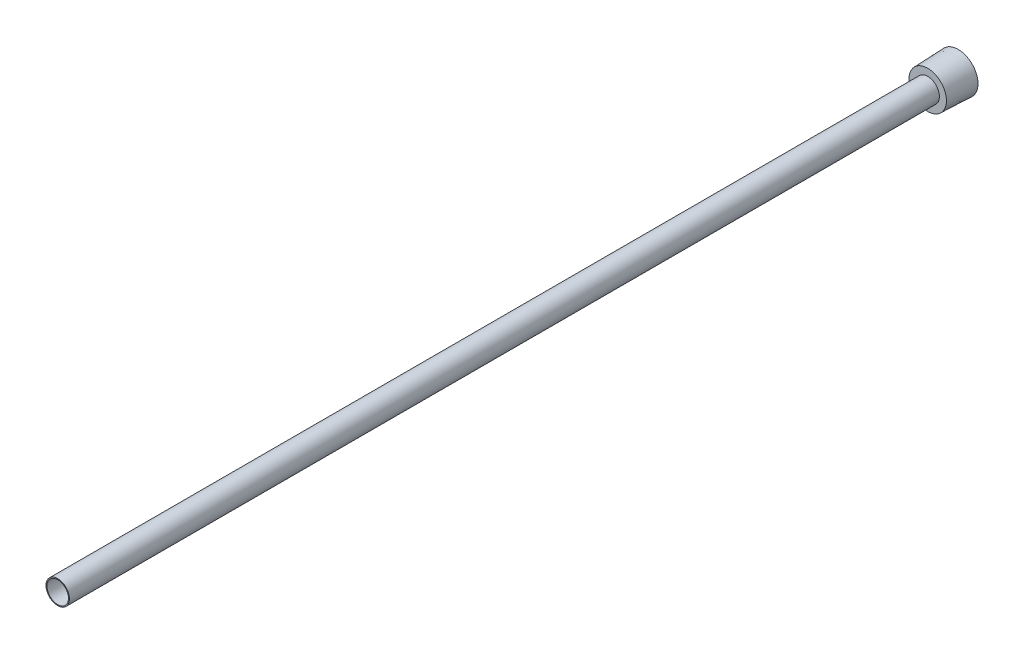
ISO-10303-21;
HEADER;
FILE_DESCRIPTION(('STEP AP214'),'2;1');
FILE_NAME('part.step','',(''),(''),'','','');
FILE_SCHEMA(('AUTOMOTIVE_DESIGN { 1 0 10303 214 1 1 1 1 }'));
ENDSEC;
DATA;
#1=APPLICATION_CONTEXT('core data for automotive mechanical design processes');
#2=APPLICATION_PROTOCOL_DEFINITION('international standard','automotive_design',2000,#1);
#3=PRODUCT_CONTEXT('',#1,'mechanical');
#4=PRODUCT('Part','Part','',(#3));
#5=PRODUCT_RELATED_PRODUCT_CATEGORY('part','',(#4));
#6=PRODUCT_DEFINITION_FORMATION('','',#4);
#7=PRODUCT_DEFINITION_CONTEXT('part definition',#1,'design');
#8=PRODUCT_DEFINITION('design','',#6,#7);
#9=PRODUCT_DEFINITION_SHAPE('','',#8);
#10=(LENGTH_UNIT() NAMED_UNIT(*) SI_UNIT(.MILLI.,.METRE.));
#11=(NAMED_UNIT(*) PLANE_ANGLE_UNIT() SI_UNIT($,.RADIAN.));
#12=(NAMED_UNIT(*) SI_UNIT($,.STERADIAN.) SOLID_ANGLE_UNIT());
#13=UNCERTAINTY_MEASURE_WITH_UNIT(LENGTH_MEASURE(1.E-05),#10,'distance_accuracy_value','');
#14=(GEOMETRIC_REPRESENTATION_CONTEXT(3) GLOBAL_UNCERTAINTY_ASSIGNED_CONTEXT((#13)) GLOBAL_UNIT_ASSIGNED_CONTEXT((#10,
#11,#12)) REPRESENTATION_CONTEXT('',''));
#15=CARTESIAN_POINT('',(0.,0.,0.));
#16=DIRECTION('',(0.,0.,1.));
#17=DIRECTION('',(1.,0.,0.));
#18=AXIS2_PLACEMENT_3D('',#15,#16,#17);
#19=CARTESIAN_POINT('',(0.,0.,0.));
#20=DIRECTION('',(0.,0.,1.));
#21=DIRECTION('',(1.,0.,0.));
#22=AXIS2_PLACEMENT_3D('',#19,#20,#21);
#23=CYLINDRICAL_SURFACE('',#22,3.65125);
#24=CARTESIAN_POINT('',(0.,0.,304.8));
#25=DIRECTION('',(0.,0.,1.));
#26=DIRECTION('',(1.,0.,0.));
#27=AXIS2_PLACEMENT_3D('',#24,#25,#26);
#28=CIRCLE('',#27,3.65125);
#29=CARTESIAN_POINT('',(3.65125,0.,304.8));
#30=VERTEX_POINT('',#29);
#31=EDGE_CURVE('E141',#30,#30,#28,.T.);
#32=CARTESIAN_POINT('',(0.,0.,6.35));
#33=DIRECTION('',(0.,0.,-1.));
#34=DIRECTION('',(-1.,0.,0.));
#35=AXIS2_PLACEMENT_3D('',#32,#33,#34);
#36=CIRCLE('',#35,3.65125);
#37=CARTESIAN_POINT('',(3.65125,0.,6.35));
#38=VERTEX_POINT('',#37);
#39=EDGE_CURVE('E36',#38,#38,#36,.F.);
#40=CARTESIAN_POINT('',(3.65125,0.,304.8));
#41=CARTESIAN_POINT('',(3.65125,0.,301.691145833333));
#42=CARTESIAN_POINT('',(3.65125,0.,298.582291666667));
#43=CARTESIAN_POINT('',(3.65125,0.,292.364583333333));
#44=CARTESIAN_POINT('',(3.65125,0.,289.255729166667));
#45=CARTESIAN_POINT('',(3.65125,0.,283.038020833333));
#46=CARTESIAN_POINT('',(3.65125,0.,279.929166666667));
#47=CARTESIAN_POINT('',(3.65125,0.,273.711458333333));
#48=CARTESIAN_POINT('',(3.65125,0.,270.602604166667));
#49=CARTESIAN_POINT('',(3.65125,0.,264.384895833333));
#50=CARTESIAN_POINT('',(3.65125,0.,261.276041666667));
#51=CARTESIAN_POINT('',(3.65125,0.,255.058333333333));
#52=CARTESIAN_POINT('',(3.65125,0.,251.949479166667));
#53=CARTESIAN_POINT('',(3.65125,0.,245.731770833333));
#54=CARTESIAN_POINT('',(3.65125,0.,242.622916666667));
#55=CARTESIAN_POINT('',(3.65125,0.,236.405208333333));
#56=CARTESIAN_POINT('',(3.65125,0.,233.296354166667));
#57=CARTESIAN_POINT('',(3.65125,0.,227.078645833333));
#58=CARTESIAN_POINT('',(3.65125,0.,223.969791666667));
#59=CARTESIAN_POINT('',(3.65125,0.,217.752083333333));
#60=CARTESIAN_POINT('',(3.65125,0.,214.643229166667));
#61=CARTESIAN_POINT('',(3.65125,0.,208.425520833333));
#62=CARTESIAN_POINT('',(3.65125,0.,205.316666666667));
#63=CARTESIAN_POINT('',(3.65125,0.,199.098958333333));
#64=CARTESIAN_POINT('',(3.65125,0.,195.990104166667));
#65=CARTESIAN_POINT('',(3.65125,0.,189.772395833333));
#66=CARTESIAN_POINT('',(3.65125,0.,186.663541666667));
#67=CARTESIAN_POINT('',(3.65125,0.,180.445833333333));
#68=CARTESIAN_POINT('',(3.65125,0.,177.336979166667));
#69=CARTESIAN_POINT('',(3.65125,0.,171.119270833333));
#70=CARTESIAN_POINT('',(3.65125,0.,168.010416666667));
#71=CARTESIAN_POINT('',(3.65125,0.,161.792708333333));
#72=CARTESIAN_POINT('',(3.65125,0.,158.683854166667));
#73=CARTESIAN_POINT('',(3.65125,0.,152.466145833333));
#74=CARTESIAN_POINT('',(3.65125,0.,149.357291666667));
#75=CARTESIAN_POINT('',(3.65125,0.,143.139583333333));
#76=CARTESIAN_POINT('',(3.65125,0.,140.030729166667));
#77=CARTESIAN_POINT('',(3.65125,0.,133.813020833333));
#78=CARTESIAN_POINT('',(3.65125,0.,130.704166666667));
#79=CARTESIAN_POINT('',(3.65125,0.,124.486458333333));
#80=CARTESIAN_POINT('',(3.65125,0.,121.377604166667));
#81=CARTESIAN_POINT('',(3.65125,0.,115.159895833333));
#82=CARTESIAN_POINT('',(3.65125,0.,112.051041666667));
#83=CARTESIAN_POINT('',(3.65125,0.,105.833333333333));
#84=CARTESIAN_POINT('',(3.65125,0.,102.724479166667));
#85=CARTESIAN_POINT('',(3.65125,0.,96.5067708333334));
#86=CARTESIAN_POINT('',(3.65125,0.,93.3979166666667));
#87=CARTESIAN_POINT('',(3.65125,0.,87.1802083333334));
#88=CARTESIAN_POINT('',(3.65125,0.,84.0713541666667));
#89=CARTESIAN_POINT('',(3.65125,0.,77.8536458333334));
#90=CARTESIAN_POINT('',(3.65125,0.,74.7447916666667));
#91=CARTESIAN_POINT('',(3.65125,0.,68.5270833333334));
#92=CARTESIAN_POINT('',(3.65125,0.,65.4182291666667));
#93=CARTESIAN_POINT('',(3.65125,0.,59.2005208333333));
#94=CARTESIAN_POINT('',(3.65125,0.,56.0916666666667));
#95=CARTESIAN_POINT('',(3.65125,0.,49.8739583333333));
#96=CARTESIAN_POINT('',(3.65125,0.,46.7651041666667));
#97=CARTESIAN_POINT('',(3.65125,0.,40.5473958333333));
#98=CARTESIAN_POINT('',(3.65125,0.,37.4385416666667));
#99=CARTESIAN_POINT('',(3.65125,0.,31.2208333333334));
#100=CARTESIAN_POINT('',(3.65125,0.,28.1119791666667));
#101=CARTESIAN_POINT('',(3.65125,0.,21.8942708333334));
#102=CARTESIAN_POINT('',(3.65125,0.,18.7854166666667));
#103=CARTESIAN_POINT('',(3.65125,0.,12.5677083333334));
#104=CARTESIAN_POINT('',(3.65125,0.,9.45885416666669));
#105=CARTESIAN_POINT('',(3.65125,0.,6.35000000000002));
#106=B_SPLINE_CURVE_WITH_KNOTS('',3,(#40,#41,#42,#43,#44,#45,#46,#47,#48,#49,#50,#51,#52,#53,
#54,#55,#56,#57,#58,#59,#60,#61,#62,#63,#64,#65,#66,#67,#68,#69,#70,#71,#72,#73,#74,#75,#76,#77,
#78,#79,#80,#81,#82,#83,#84,#85,#86,#87,#88,#89,#90,#91,#92,#93,#94,#95,#96,#97,#98,#99,#100,
#101,#102,#103,#104,#105),.UNSPECIFIED.,.F.,.F.,(4,2,2,2,2,2,2,2,2,2,2,2,2,2,2,2,2,2,2,2,2,2,2,
2,2,2,2,2,2,2,2,2,4),(0.,9.32656250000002,18.653125,27.9796875,37.30625,46.6328125,55.959375,
65.2859375,74.6125,83.9390625,93.265625,102.5921875,111.91875,121.2453125,130.571875,
139.8984375,149.225,158.5515625,167.878125,177.2046875,186.53125,195.8578125,205.184375,
214.5109375,223.8375,233.1640625,242.490625,251.8171875,261.14375,270.4703125,279.796875,
289.1234375,298.45),.UNSPECIFIED.);
#107=EDGE_CURVE('BSEAM32',#30,#38,#106,.T.);
#108=ORIENTED_EDGE('',*,*,#31,.T.);
#109=ORIENTED_EDGE('',*,*,#39,.F.);
#110=ORIENTED_EDGE('',*,*,#107,.T.);
#111=ORIENTED_EDGE('',*,*,#107,.F.);
#112=EDGE_LOOP('',(#108,#110,#109,#111));
#113=FACE_BOUND('',#112,.T.);
#114=ADVANCED_FACE('F32',(#113),#23,.F.);
#115=CARTESIAN_POINT('',(0.,0.,0.));
#116=DIRECTION('',(0.,0.,-1.));
#117=DIRECTION('',(-1.,0.,0.));
#118=AXIS2_PLACEMENT_3D('',#115,#116,#117);
#119=CONICAL_SURFACE('',#118,6.7183,0.0364599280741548);
#120=CARTESIAN_POINT('',(0.,0.,10.3124));
#121=DIRECTION('',(0.,0.,1.));
#122=DIRECTION('',(1.,0.,0.));
#123=AXIS2_PLACEMENT_3D('',#120,#121,#122);
#124=CIRCLE('',#123,6.34214394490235);
#125=CARTESIAN_POINT('',(6.34214394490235,0.,10.3124));
#126=VERTEX_POINT('',#125);
#127=EDGE_CURVE('E11',#126,#126,#124,.T.);
#128=ORIENTED_EDGE('',*,*,#127,.F.);
#129=EDGE_LOOP('',(#128));
#130=FACE_BOUND('',#129,.T.);
#131=CARTESIAN_POINT('',(0.,0.,0.));
#132=DIRECTION('',(0.,0.,1.));
#133=DIRECTION('',(1.,0.,0.));
#134=AXIS2_PLACEMENT_3D('',#131,#132,#133);
#135=CIRCLE('',#134,6.7183);
#136=CARTESIAN_POINT('',(6.7183,0.,0.));
#137=VERTEX_POINT('',#136);
#138=EDGE_CURVE('E144',#137,#137,#135,.T.);
#139=ORIENTED_EDGE('',*,*,#138,.T.);
#140=EDGE_LOOP('',(#139));
#141=FACE_BOUND('',#140,.T.);
#142=ADVANCED_FACE('F34',(#130,#141),#119,.T.);
#143=CARTESIAN_POINT('',(0.,6.34214394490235,10.3124));
#144=DIRECTION('',(0.,0.,-1.));
#145=DIRECTION('',(-1.,0.,0.));
#146=AXIS2_PLACEMENT_3D('',#143,#144,#145);
#147=PLANE('',#146);
#148=CARTESIAN_POINT('',(0.,0.,10.3124));
#149=DIRECTION('',(0.,0.,1.));
#150=DIRECTION('',(1.,0.,0.));
#151=AXIS2_PLACEMENT_3D('',#148,#149,#150);
#152=CIRCLE('',#151,3.96875);
#153=CARTESIAN_POINT('',(3.96875,0.,10.3124));
#154=VERTEX_POINT('',#153);
#155=EDGE_CURVE('E41',#154,#154,#152,.T.);
#156=ORIENTED_EDGE('',*,*,#155,.F.);
#157=EDGE_LOOP('',(#156));
#158=FACE_BOUND('',#157,.T.);
#159=ORIENTED_EDGE('',*,*,#127,.T.);
#160=EDGE_LOOP('',(#159));
#161=FACE_BOUND('',#160,.T.);
#162=ADVANCED_FACE('F155',(#158,#161),#147,.F.);
#163=CARTESIAN_POINT('',(0.,0.,331.124179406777));
#164=DIRECTION('',(0.,0.,1.));
#165=DIRECTION('',(1.,0.,0.));
#166=AXIS2_PLACEMENT_3D('',#163,#164,#165);
#167=CYLINDRICAL_SURFACE('',#166,3.96874999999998);
#168=CARTESIAN_POINT('',(0.,0.,304.8));
#169=DIRECTION('',(0.,0.,1.));
#170=DIRECTION('',(1.,0.,0.));
#171=AXIS2_PLACEMENT_3D('',#168,#169,#170);
#172=CIRCLE('',#171,3.96874999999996);
#173=CARTESIAN_POINT('',(3.96874999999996,0.,304.8));
#174=VERTEX_POINT('',#173);
#175=EDGE_CURVE('E147',#174,#174,#172,.T.);
#176=ORIENTED_EDGE('',*,*,#175,.F.);
#177=EDGE_LOOP('',(#176));
#178=FACE_BOUND('',#177,.T.);
#179=ORIENTED_EDGE('',*,*,#155,.T.);
#180=EDGE_LOOP('',(#179));
#181=FACE_BOUND('',#180,.T.);
#182=ADVANCED_FACE('F153',(#178,#181),#167,.T.);
#183=CARTESIAN_POINT('',(0.,3.96874999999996,304.8));
#184=DIRECTION('',(0.,0.,-1.));
#185=DIRECTION('',(-1.,0.,0.));
#186=AXIS2_PLACEMENT_3D('',#183,#184,#185);
#187=PLANE('',#186);
#188=ORIENTED_EDGE('',*,*,#31,.F.);
#189=EDGE_LOOP('',(#188));
#190=FACE_BOUND('',#189,.T.);
#191=ORIENTED_EDGE('',*,*,#175,.T.);
#192=EDGE_LOOP('',(#191));
#193=FACE_BOUND('',#192,.T.);
#194=ADVANCED_FACE('F166',(#190,#193),#187,.F.);
#195=CARTESIAN_POINT('',(0.,0.,0.));
#196=DIRECTION('',(0.,0.,1.));
#197=DIRECTION('',(1.,0.,0.));
#198=AXIS2_PLACEMENT_3D('',#195,#196,#197);
#199=PLANE('',#198);
#200=DIRECTION('',(-0.866025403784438,-0.5,0.));
#201=VECTOR('',#200,1.);
#202=CARTESIAN_POINT('',(4.7625,-2.74963065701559,0.));
#203=LINE('',#202,#201);
#204=CARTESIAN_POINT('',(4.7625,-2.74963065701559,0.));
#205=VERTEX_POINT('',#204);
#206=CARTESIAN_POINT('',(0.,-5.49926131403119,0.));
#207=VERTEX_POINT('',#206);
#208=EDGE_CURVE('E123',#205,#207,#203,.T.);
#209=ORIENTED_EDGE('',*,*,#208,.F.);
#210=DIRECTION('',(0.,-1.,0.));
#211=VECTOR('',#210,1.);
#212=CARTESIAN_POINT('',(4.7625,2.74963065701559,0.));
#213=LINE('',#212,#211);
#214=CARTESIAN_POINT('',(4.7625,2.74963065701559,0.));
#215=VERTEX_POINT('',#214);
#216=EDGE_CURVE('E48',#215,#205,#213,.T.);
#217=ORIENTED_EDGE('',*,*,#216,.F.);
#218=DIRECTION('',(0.866025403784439,-0.5,0.));
#219=VECTOR('',#218,1.);
#220=CARTESIAN_POINT('',(0.,5.49926131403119,0.));
#221=LINE('',#220,#219);
#222=CARTESIAN_POINT('',(0.,5.49926131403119,0.));
#223=VERTEX_POINT('',#222);
#224=EDGE_CURVE('E132',#223,#215,#221,.T.);
#225=ORIENTED_EDGE('',*,*,#224,.F.);
#226=DIRECTION('',(0.866025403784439,0.5,0.));
#227=VECTOR('',#226,1.);
#228=CARTESIAN_POINT('',(-4.7625,2.7496306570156,0.));
#229=LINE('',#228,#227);
#230=CARTESIAN_POINT('',(-4.7625,2.7496306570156,0.));
#231=VERTEX_POINT('',#230);
#232=EDGE_CURVE('E130',#231,#223,#229,.T.);
#233=ORIENTED_EDGE('',*,*,#232,.F.);
#234=DIRECTION('',(0.,1.,0.));
#235=VECTOR('',#234,1.);
#236=CARTESIAN_POINT('',(-4.7625,-2.74963065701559,0.));
#237=LINE('',#236,#235);
#238=CARTESIAN_POINT('',(-4.7625,-2.74963065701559,0.));
#239=VERTEX_POINT('',#238);
#240=EDGE_CURVE('E96',#239,#231,#237,.T.);
#241=ORIENTED_EDGE('',*,*,#240,.F.);
#242=DIRECTION('',(-0.866025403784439,0.5,0.));
#243=VECTOR('',#242,1.);
#244=CARTESIAN_POINT('',(0.,-5.49926131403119,0.));
#245=LINE('',#244,#243);
#246=EDGE_CURVE('E126',#207,#239,#245,.T.);
#247=ORIENTED_EDGE('',*,*,#246,.F.);
#248=EDGE_LOOP('',(#209,#217,#225,#233,#241,#247));
#249=FACE_BOUND('',#248,.T.);
#250=ORIENTED_EDGE('',*,*,#138,.F.);
#251=EDGE_LOOP('',(#250));
#252=FACE_BOUND('',#251,.T.);
#253=ADVANCED_FACE('F164',(#249,#252),#199,.F.);
#254=CARTESIAN_POINT('',(4.7625,-2.74963065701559,6.35));
#255=DIRECTION('',(0.,0.,-1.));
#256=DIRECTION('',(-1.,0.,0.));
#257=AXIS2_PLACEMENT_3D('',#254,#255,#256);
#258=PLANE('',#257);
#259=DIRECTION('',(0.,-1.,0.));
#260=VECTOR('',#259,1.);
#261=CARTESIAN_POINT('',(4.7625,2.74963065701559,6.35));
#262=LINE('',#261,#260);
#263=CARTESIAN_POINT('',(4.7625,2.74963065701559,6.35));
#264=VERTEX_POINT('',#263);
#265=CARTESIAN_POINT('',(4.7625,-2.74963065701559,6.35));
#266=VERTEX_POINT('',#265);
#267=EDGE_CURVE('E134',#264,#266,#262,.T.);
#268=ORIENTED_EDGE('',*,*,#267,.T.);
#269=DIRECTION('',(-0.866025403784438,-0.5,0.));
#270=VECTOR('',#269,1.);
#271=CARTESIAN_POINT('',(4.7625,-2.74963065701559,6.35));
#272=LINE('',#271,#270);
#273=CARTESIAN_POINT('',(0.,-5.49926131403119,6.35));
#274=VERTEX_POINT('',#273);
#275=EDGE_CURVE('E117',#266,#274,#272,.T.);
#276=ORIENTED_EDGE('',*,*,#275,.T.);
#277=DIRECTION('',(-0.866025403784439,0.5,0.));
#278=VECTOR('',#277,1.);
#279=CARTESIAN_POINT('',(0.,-5.49926131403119,6.35));
#280=LINE('',#279,#278);
#281=CARTESIAN_POINT('',(-4.7625,-2.74963065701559,6.35));
#282=VERTEX_POINT('',#281);
#283=EDGE_CURVE('E115',#274,#282,#280,.T.);
#284=ORIENTED_EDGE('',*,*,#283,.T.);
#285=DIRECTION('',(0.,1.,0.));
#286=VECTOR('',#285,1.);
#287=CARTESIAN_POINT('',(-4.7625,-2.74963065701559,6.35));
#288=LINE('',#287,#286);
#289=CARTESIAN_POINT('',(-4.7625,2.7496306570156,6.35));
#290=VERTEX_POINT('',#289);
#291=EDGE_CURVE('E93',#282,#290,#288,.T.);
#292=ORIENTED_EDGE('',*,*,#291,.T.);
#293=DIRECTION('',(0.866025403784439,0.5,0.));
#294=VECTOR('',#293,1.);
#295=CARTESIAN_POINT('',(-4.7625,2.7496306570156,6.35));
#296=LINE('',#295,#294);
#297=CARTESIAN_POINT('',(0.,5.49926131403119,6.35));
#298=VERTEX_POINT('',#297);
#299=EDGE_CURVE('E104',#290,#298,#296,.T.);
#300=ORIENTED_EDGE('',*,*,#299,.T.);
#301=DIRECTION('',(0.866025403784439,-0.5,0.));
#302=VECTOR('',#301,1.);
#303=CARTESIAN_POINT('',(0.,5.49926131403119,6.35));
#304=LINE('',#303,#302);
#305=EDGE_CURVE('E108',#298,#264,#304,.T.);
#306=ORIENTED_EDGE('',*,*,#305,.T.);
#307=EDGE_LOOP('',(#268,#276,#284,#292,#300,#306));
#308=FACE_BOUND('',#307,.T.);
#309=ORIENTED_EDGE('',*,*,#39,.T.);
#310=EDGE_LOOP('',(#309));
#311=FACE_BOUND('',#310,.T.);
#312=ADVANCED_FACE('F111',(#308,#311),#258,.T.);
#313=CARTESIAN_POINT('',(4.7625,2.74963065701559,6.35));
#314=DIRECTION('',(1.,0.,0.));
#315=DIRECTION('',(0.,1.,0.));
#316=AXIS2_PLACEMENT_3D('',#313,#314,#315);
#317=PLANE('',#316);
#318=ORIENTED_EDGE('',*,*,#216,.T.);
#319=DIRECTION('',(0.,0.,-1.));
#320=VECTOR('',#319,1.);
#321=CARTESIAN_POINT('',(4.7625,-2.74963065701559,6.35));
#322=LINE('',#321,#320);
#323=EDGE_CURVE('E78',#266,#205,#322,.T.);
#324=ORIENTED_EDGE('',*,*,#323,.F.);
#325=ORIENTED_EDGE('',*,*,#267,.F.);
#326=DIRECTION('',(0.,0.,-1.));
#327=VECTOR('',#326,1.);
#328=CARTESIAN_POINT('',(4.7625,2.74963065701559,6.35));
#329=LINE('',#328,#327);
#330=EDGE_CURVE('E56',#264,#215,#329,.T.);
#331=ORIENTED_EDGE('',*,*,#330,.T.);
#332=EDGE_LOOP('',(#318,#324,#325,#331));
#333=FACE_BOUND('',#332,.T.);
#334=ADVANCED_FACE('F173',(#333),#317,.F.);
#335=CARTESIAN_POINT('',(0.,5.49926131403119,6.35));
#336=DIRECTION('',(0.5,0.866025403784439,0.));
#337=DIRECTION('',(-0.866025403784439,0.5,0.));
#338=AXIS2_PLACEMENT_3D('',#335,#336,#337);
#339=PLANE('',#338);
#340=ORIENTED_EDGE('',*,*,#224,.T.);
#341=ORIENTED_EDGE('',*,*,#330,.F.);
#342=ORIENTED_EDGE('',*,*,#305,.F.);
#343=DIRECTION('',(0.,0.,-1.));
#344=VECTOR('',#343,1.);
#345=CARTESIAN_POINT('',(0.,5.49926131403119,6.35));
#346=LINE('',#345,#344);
#347=EDGE_CURVE('E100',#298,#223,#346,.T.);
#348=ORIENTED_EDGE('',*,*,#347,.T.);
#349=EDGE_LOOP('',(#340,#341,#342,#348));
#350=FACE_BOUND('',#349,.T.);
#351=ADVANCED_FACE('F187',(#350),#339,.F.);
#352=CARTESIAN_POINT('',(-4.7625,2.7496306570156,6.35));
#353=DIRECTION('',(-0.5,0.866025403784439,0.));
#354=DIRECTION('',(-0.866025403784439,-0.5,0.));
#355=AXIS2_PLACEMENT_3D('',#352,#353,#354);
#356=PLANE('',#355);
#357=ORIENTED_EDGE('',*,*,#232,.T.);
#358=ORIENTED_EDGE('',*,*,#347,.F.);
#359=ORIENTED_EDGE('',*,*,#299,.F.);
#360=DIRECTION('',(0.,0.,-1.));
#361=VECTOR('',#360,1.);
#362=CARTESIAN_POINT('',(-4.7625,2.7496306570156,6.35));
#363=LINE('',#362,#361);
#364=EDGE_CURVE('E89',#290,#231,#363,.T.);
#365=ORIENTED_EDGE('',*,*,#364,.T.);
#366=EDGE_LOOP('',(#357,#358,#359,#365));
#367=FACE_BOUND('',#366,.T.);
#368=ADVANCED_FACE('F105',(#367),#356,.F.);
#369=CARTESIAN_POINT('',(-4.7625,-2.74963065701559,6.35));
#370=DIRECTION('',(-1.,0.,0.));
#371=DIRECTION('',(0.,0.,1.));
#372=AXIS2_PLACEMENT_3D('',#369,#370,#371);
#373=PLANE('',#372);
#374=ORIENTED_EDGE('',*,*,#240,.T.);
#375=ORIENTED_EDGE('',*,*,#364,.F.);
#376=ORIENTED_EDGE('',*,*,#291,.F.);
#377=DIRECTION('',(0.,0.,-1.));
#378=VECTOR('',#377,1.);
#379=CARTESIAN_POINT('',(-4.7625,-2.74963065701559,6.35));
#380=LINE('',#379,#378);
#381=EDGE_CURVE('E101',#282,#239,#380,.T.);
#382=ORIENTED_EDGE('',*,*,#381,.T.);
#383=EDGE_LOOP('',(#374,#375,#376,#382));
#384=FACE_BOUND('',#383,.T.);
#385=ADVANCED_FACE('F91',(#384),#373,.F.);
#386=CARTESIAN_POINT('',(0.,-5.49926131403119,6.35));
#387=DIRECTION('',(-0.5,-0.866025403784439,0.));
#388=DIRECTION('',(0.866025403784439,-0.5,0.));
#389=AXIS2_PLACEMENT_3D('',#386,#387,#388);
#390=PLANE('',#389);
#391=ORIENTED_EDGE('',*,*,#246,.T.);
#392=ORIENTED_EDGE('',*,*,#381,.F.);
#393=ORIENTED_EDGE('',*,*,#283,.F.);
#394=DIRECTION('',(0.,0.,-1.));
#395=VECTOR('',#394,1.);
#396=CARTESIAN_POINT('',(0.,-5.49926131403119,6.35));
#397=LINE('',#396,#395);
#398=EDGE_CURVE('E138',#274,#207,#397,.T.);
#399=ORIENTED_EDGE('',*,*,#398,.T.);
#400=EDGE_LOOP('',(#391,#392,#393,#399));
#401=FACE_BOUND('',#400,.T.);
#402=ADVANCED_FACE('F191',(#401),#390,.F.);
#403=CARTESIAN_POINT('',(4.7625,-2.74963065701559,6.35));
#404=DIRECTION('',(0.5,-0.866025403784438,0.));
#405=DIRECTION('',(0.866025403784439,0.5,0.));
#406=AXIS2_PLACEMENT_3D('',#403,#404,#405);
#407=PLANE('',#406);
#408=ORIENTED_EDGE('',*,*,#208,.T.);
#409=ORIENTED_EDGE('',*,*,#398,.F.);
#410=ORIENTED_EDGE('',*,*,#275,.F.);
#411=ORIENTED_EDGE('',*,*,#323,.T.);
#412=EDGE_LOOP('',(#408,#409,#410,#411));
#413=FACE_BOUND('',#412,.T.);
#414=ADVANCED_FACE('F188',(#413),#407,.F.);
#415=CLOSED_SHELL('',(#114,#142,#162,#182,#194,#253,#312,#334,#351,#368,#385,#402,#414));
#416=MANIFOLD_SOLID_BREP('B2',#415);
#417=ADVANCED_BREP_SHAPE_REPRESENTATION('',(#18,#416),#14);
#418=SHAPE_DEFINITION_REPRESENTATION(#9,#417);
ENDSEC;
END-ISO-10303-21;
